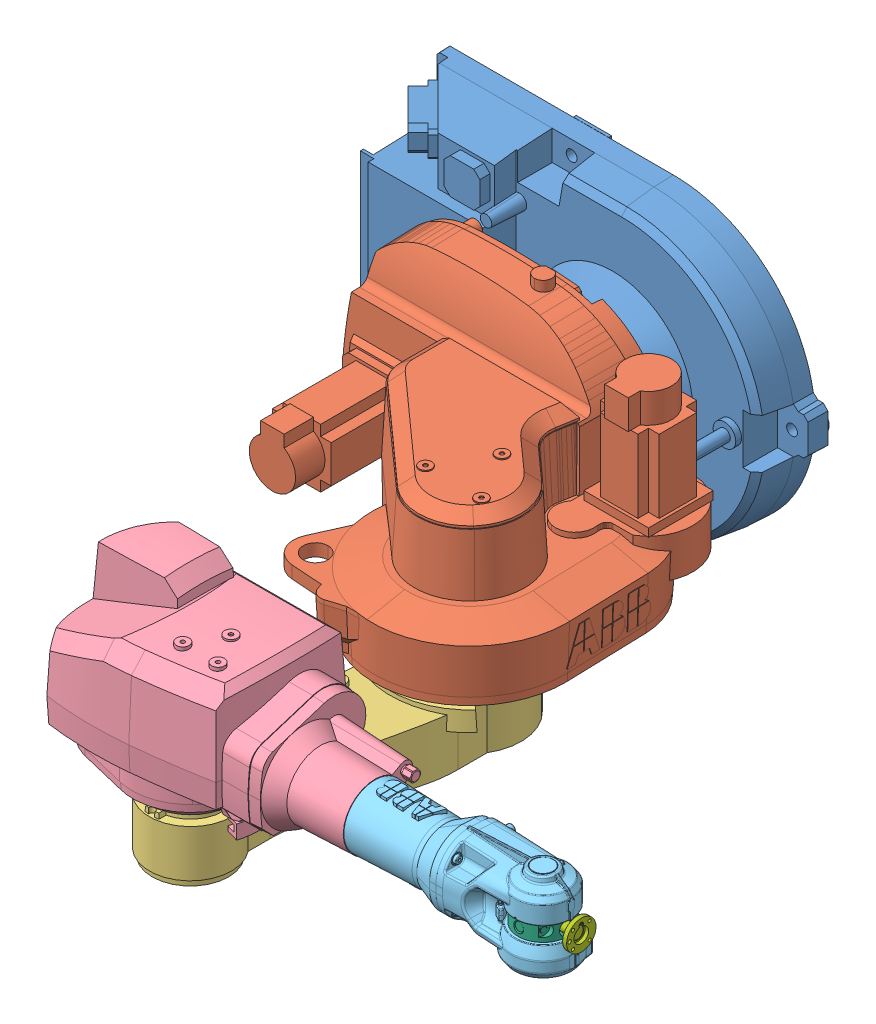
SolidWorks assembly IRB1600_X-120.SLDASM, configuration Default (file format 13000). Lengths in mm.
Overall size (1197.36 510.23 1069.47).
7 component instances, 7 part files, 0 mates.
Components (placement in the parent):
- IRB1600_X-120_IRC5_rev2_BASE-1: IRB1600_X-120_IRC5_rev2_BASE.SLDPRT [Default] at origin size (660.28 510.23 171)
- IRB1600_X-120_IRC5_rev2_LINK1-1: IRB1600_X-120_IRC5_rev2_LINK1.SLDPRT [Default] at origin size (601.3 362.57 535.06)
- IRB1600_X-120_IRC5_rev2_LINK2-1: IRB1600_X-120_IRC5_rev2_LINK2.SLDPRT [Default] at origin size (223.34 148.57 633.2)
- IRB1600_X-120_IRC5_rev2_LINK3-1: IRB1600_X-120_IRC5_rev2_LINK3.SLDPRT [Default] at origin size (508.6 281 243.82)
- IRB1600_X-120_IRC5_rev2_LINK4-1: IRB1600_X-120_IRC5_rev2_LINK4.SLDPRT [Default] at origin size (342.65 134.49 112.07)
- IRB1600_X-120_IRC5_rev2_LINK5-1: IRB1600_X-120_IRC5_rev2_LINK5.SLDPRT [Default] at origin size (84.6 49 84.6)
- IRB1600_X-120_IRC5_rev2_LINK6-2: IRB1600_X-120_IRC5_rev2_LINK6.SLDPRT [Default] at origin size (98.08 50 50)
